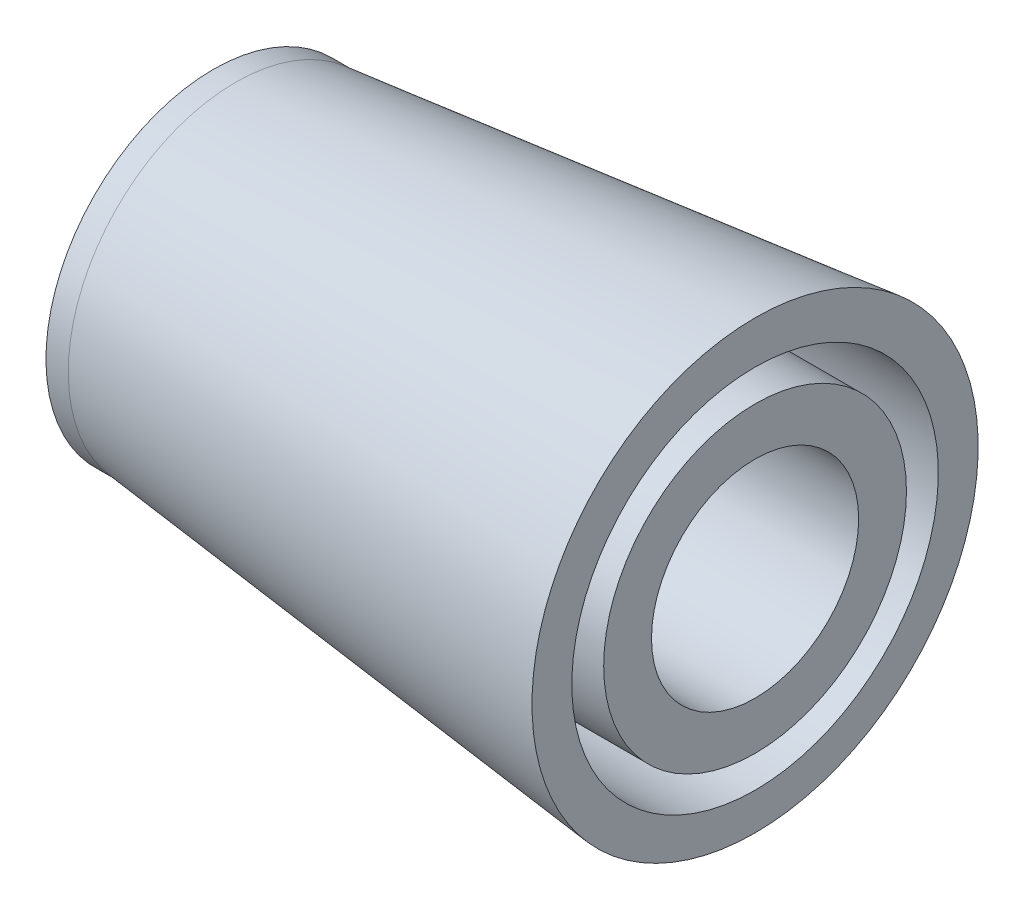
from build123d import *

# Parameters (mm, degrees)
SKICA2_R                 = 3.25
ODEBRAT_VYSUNUT_M2_DEPTH = 15
SKICA2_4_R               = 5.75
SKICA2_4_R_2             = 4.75
ODEBRAT_VYSUNUT_M3_DEPTH = 5


with BuildPart() as part:
    # Skica1 → Rotovat1 (revolve)
    with BuildSketch(Plane.XY):
        Polygon((-5.226481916, 0), (-5.226481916, 5.25), (-4.526481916, 5.25), (11.773518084, 7), (11.773518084, 0), align=None)
    revolve(axis=Axis((11.773518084, 0, 0), (-1, 0, 0)))

    # Skica2 → Odebrat vysunut_m2 (cut)
    with BuildSketch(Plane(origin=(11.773518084, 0, 0), x_dir=(0, 0, -1), z_dir=(1, 0, 0))):
        with Locations(Location((0, -0.0888345, 0), (0, 0, 90))):
            Circle(SKICA2_R)
    extrude(amount=-ODEBRAT_VYSUNUT_M2_DEPTH, mode=Mode.SUBTRACT)

    # Skica2_4 → Odebrat vysunut_m3 (cut)
    with BuildSketch(Plane(origin=(11.773518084, 0, 0), x_dir=(0, 0, -1), z_dir=(1, 0, 0))):
        with Locations(Location((0, -0.0888345, 0), (0, 0, 90))):
            Circle(SKICA2_4_R)
        with Locations(Location((0, -0.0888345, 0), (0, 0, 90))):
            Circle(SKICA2_4_R_2, mode=Mode.SUBTRACT)
    extrude(amount=-ODEBRAT_VYSUNUT_M3_DEPTH, mode=Mode.SUBTRACT)


solid = part.part
